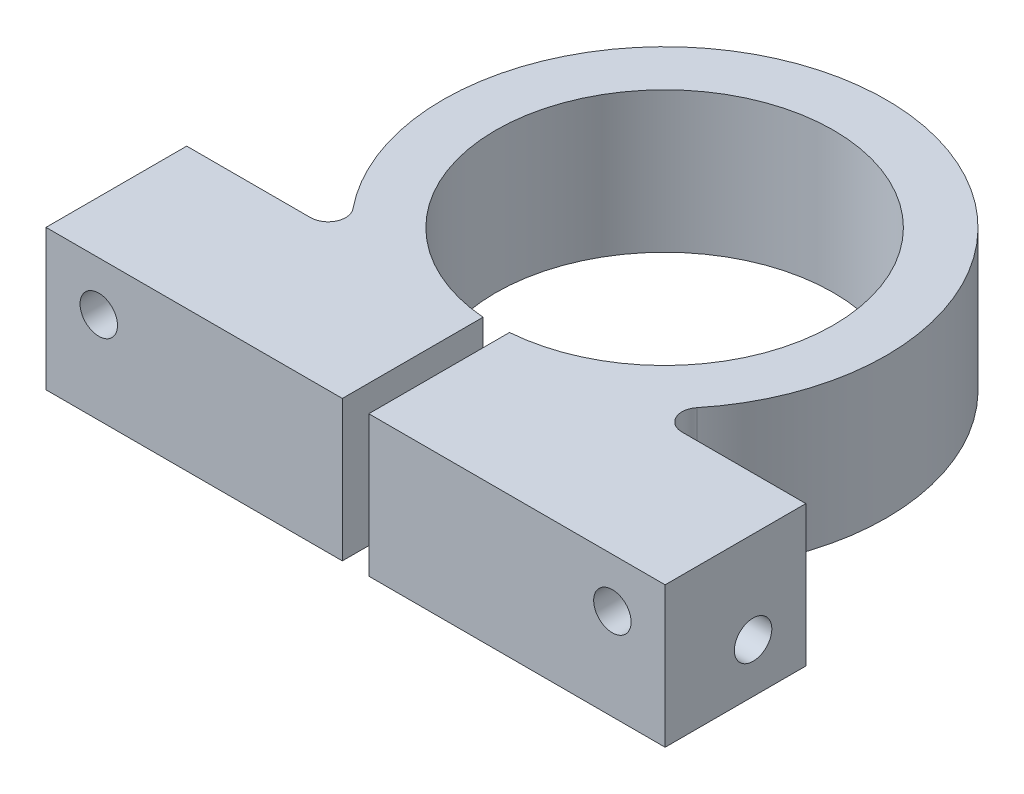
ISO-10303-21;
HEADER;
FILE_DESCRIPTION(('STEP AP214'),'2;1');
FILE_NAME('part.step','',(''),(''),'','','');
FILE_SCHEMA(('AUTOMOTIVE_DESIGN { 1 0 10303 214 1 1 1 1 }'));
ENDSEC;
DATA;
#1=APPLICATION_CONTEXT('core data for automotive mechanical design processes');
#2=APPLICATION_PROTOCOL_DEFINITION('international standard','automotive_design',2000,#1);
#3=PRODUCT_CONTEXT('',#1,'mechanical');
#4=PRODUCT('Part','Part','',(#3));
#5=PRODUCT_RELATED_PRODUCT_CATEGORY('part','',(#4));
#6=PRODUCT_DEFINITION_FORMATION('','',#4);
#7=PRODUCT_DEFINITION_CONTEXT('part definition',#1,'design');
#8=PRODUCT_DEFINITION('design','',#6,#7);
#9=PRODUCT_DEFINITION_SHAPE('','',#8);
#10=(LENGTH_UNIT() NAMED_UNIT(*) SI_UNIT(.MILLI.,.METRE.));
#11=(NAMED_UNIT(*) PLANE_ANGLE_UNIT() SI_UNIT($,.RADIAN.));
#12=(NAMED_UNIT(*) SI_UNIT($,.STERADIAN.) SOLID_ANGLE_UNIT());
#13=UNCERTAINTY_MEASURE_WITH_UNIT(LENGTH_MEASURE(1.E-05),#10,'distance_accuracy_value','');
#14=(GEOMETRIC_REPRESENTATION_CONTEXT(3) GLOBAL_UNCERTAINTY_ASSIGNED_CONTEXT((#13)) GLOBAL_UNIT_ASSIGNED_CONTEXT((#10,
#11,#12)) REPRESENTATION_CONTEXT('',''));
#15=CARTESIAN_POINT('',(0.,0.,0.));
#16=DIRECTION('',(0.,0.,1.));
#17=DIRECTION('',(1.,0.,0.));
#18=AXIS2_PLACEMENT_3D('',#15,#16,#17);
#19=CARTESIAN_POINT('',(-33.5269336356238,25.4,27.211341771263));
#20=DIRECTION('',(0.,-1.,0.));
#21=DIRECTION('',(0.,0.,-1.));
#22=AXIS2_PLACEMENT_3D('',#19,#20,#21);
#23=CYLINDRICAL_SURFACE('',#22,3.175);
#24=CARTESIAN_POINT('',(-33.5269336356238,0.,27.211341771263));
#25=DIRECTION('',(0.,-1.,0.));
#26=DIRECTION('',(0.,0.,1.));
#27=AXIS2_PLACEMENT_3D('',#24,#25,#26);
#28=CIRCLE('',#27,3.175);
#29=CARTESIAN_POINT('',(-31.061717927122,0.,25.2105078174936));
#30=VERTEX_POINT('',#29);
#31=CARTESIAN_POINT('',(-33.5269336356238,0.,30.386341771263));
#32=VERTEX_POINT('',#31);
#33=EDGE_CURVE('E124',#30,#32,#28,.T.);
#34=ORIENTED_EDGE('',*,*,#33,.T.);
#35=DIRECTION('',(0.,-1.,0.));
#36=VECTOR('',#35,1.);
#37=CARTESIAN_POINT('',(-33.5269336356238,25.4,30.386341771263));
#38=LINE('',#37,#36);
#39=CARTESIAN_POINT('',(-33.5269336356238,25.4,30.386341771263));
#40=VERTEX_POINT('',#39);
#41=EDGE_CURVE('E11',#40,#32,#38,.T.);
#42=ORIENTED_EDGE('',*,*,#41,.F.);
#43=CARTESIAN_POINT('',(-33.5269336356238,25.4,27.211341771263));
#44=DIRECTION('',(0.,-1.,0.));
#45=DIRECTION('',(0.,0.,1.));
#46=AXIS2_PLACEMENT_3D('',#43,#44,#45);
#47=CIRCLE('',#46,3.175);
#48=CARTESIAN_POINT('',(-31.061717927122,25.4,25.2105078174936));
#49=VERTEX_POINT('',#48);
#50=EDGE_CURVE('E164',#49,#40,#47,.T.);
#51=ORIENTED_EDGE('',*,*,#50,.F.);
#52=DIRECTION('',(0.,-1.,0.));
#53=VECTOR('',#52,1.);
#54=CARTESIAN_POINT('',(-31.061717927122,25.4,25.2105078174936));
#55=LINE('',#54,#53);
#56=EDGE_CURVE('E137',#49,#30,#55,.T.);
#57=ORIENTED_EDGE('',*,*,#56,.T.);
#58=EDGE_LOOP('',(#34,#42,#51,#57));
#59=FACE_BOUND('',#58,.T.);
#60=ADVANCED_FACE('F32',(#59),#23,.F.);
#61=CARTESIAN_POINT('',(-55.88,25.4,30.386341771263));
#62=DIRECTION('',(0.,0.,1.));
#63=DIRECTION('',(1.,0.,0.));
#64=AXIS2_PLACEMENT_3D('',#61,#62,#63);
#65=PLANE('',#64);
#66=CARTESIAN_POINT('',(-46.355,16.51,30.386341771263));
#67=DIRECTION('',(0.,0.,-1.));
#68=DIRECTION('',(-1.,0.,0.));
#69=AXIS2_PLACEMENT_3D('',#66,#67,#68);
#70=CIRCLE('',#69,3.37819999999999);
#71=CARTESIAN_POINT('',(-49.7332,16.51,30.386341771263));
#72=VERTEX_POINT('',#71);
#73=EDGE_CURVE('E305',#72,#72,#70,.T.);
#74=ORIENTED_EDGE('',*,*,#73,.F.);
#75=EDGE_LOOP('',(#74));
#76=FACE_BOUND('',#75,.T.);
#77=DIRECTION('',(-1.,0.,0.));
#78=VECTOR('',#77,1.);
#79=CARTESIAN_POINT('',(-55.88,0.,30.386341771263));
#80=LINE('',#79,#78);
#81=CARTESIAN_POINT('',(-55.88,0.,30.386341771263));
#82=VERTEX_POINT('',#81);
#83=EDGE_CURVE('E120',#32,#82,#80,.T.);
#84=ORIENTED_EDGE('',*,*,#83,.T.);
#85=DIRECTION('',(0.,-1.,0.));
#86=VECTOR('',#85,1.);
#87=CARTESIAN_POINT('',(-55.88,25.4,30.386341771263));
#88=LINE('',#87,#86);
#89=CARTESIAN_POINT('',(-55.88,25.4,30.386341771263));
#90=VERTEX_POINT('',#89);
#91=EDGE_CURVE('E39',#90,#82,#88,.T.);
#92=ORIENTED_EDGE('',*,*,#91,.F.);
#93=DIRECTION('',(-1.,0.,0.));
#94=VECTOR('',#93,1.);
#95=CARTESIAN_POINT('',(-55.88,25.4,30.386341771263));
#96=LINE('',#95,#94);
#97=EDGE_CURVE('E133',#40,#90,#96,.T.);
#98=ORIENTED_EDGE('',*,*,#97,.F.);
#99=ORIENTED_EDGE('',*,*,#41,.T.);
#100=EDGE_LOOP('',(#84,#92,#98,#99));
#101=FACE_BOUND('',#100,.T.);
#102=ADVANCED_FACE('F132',(#76,#101),#65,.F.);
#103=CARTESIAN_POINT('',(-55.88,25.4,30.386341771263));
#104=DIRECTION('',(1.,0.,0.));
#105=DIRECTION('',(0.,0.,-1.));
#106=AXIS2_PLACEMENT_3D('',#103,#104,#105);
#107=PLANE('',#106);
#108=CARTESIAN_POINT('',(-55.88,8.89,39.911341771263));
#109=DIRECTION('',(-1.,0.,0.));
#110=DIRECTION('',(0.,0.,1.));
#111=AXIS2_PLACEMENT_3D('',#108,#109,#110);
#112=CIRCLE('',#111,3.37819999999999);
#113=CARTESIAN_POINT('',(-55.88,8.89,43.2895417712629));
#114=VERTEX_POINT('',#113);
#115=EDGE_CURVE('E315',#114,#114,#112,.T.);
#116=ORIENTED_EDGE('',*,*,#115,.F.);
#117=EDGE_LOOP('',(#116));
#118=FACE_BOUND('',#117,.T.);
#119=DIRECTION('',(0.,0.,1.));
#120=VECTOR('',#119,1.);
#121=CARTESIAN_POINT('',(-55.88,0.,30.386341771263));
#122=LINE('',#121,#120);
#123=CARTESIAN_POINT('',(-55.88,0.,55.786341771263));
#124=VERTEX_POINT('',#123);
#125=EDGE_CURVE('E126',#82,#124,#122,.T.);
#126=ORIENTED_EDGE('',*,*,#125,.T.);
#127=DIRECTION('',(0.,-1.,0.));
#128=VECTOR('',#127,1.);
#129=CARTESIAN_POINT('',(-55.88,25.4,55.786341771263));
#130=LINE('',#129,#128);
#131=CARTESIAN_POINT('',(-55.88,25.4,55.786341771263));
#132=VERTEX_POINT('',#131);
#133=EDGE_CURVE('E210',#132,#124,#130,.T.);
#134=ORIENTED_EDGE('',*,*,#133,.F.);
#135=DIRECTION('',(0.,0.,1.));
#136=VECTOR('',#135,1.);
#137=CARTESIAN_POINT('',(-55.88,25.4,30.386341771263));
#138=LINE('',#137,#136);
#139=EDGE_CURVE('E167',#90,#132,#138,.T.);
#140=ORIENTED_EDGE('',*,*,#139,.F.);
#141=ORIENTED_EDGE('',*,*,#91,.T.);
#142=EDGE_LOOP('',(#126,#134,#140,#141));
#143=FACE_BOUND('',#142,.T.);
#144=ADVANCED_FACE('F214',(#118,#143),#107,.F.);
#145=CARTESIAN_POINT('',(-55.88,25.4,55.786341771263));
#146=DIRECTION('',(0.,0.,-1.));
#147=DIRECTION('',(-1.,0.,0.));
#148=AXIS2_PLACEMENT_3D('',#145,#146,#147);
#149=PLANE('',#148);
#150=CARTESIAN_POINT('',(-46.355,16.51,55.786341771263));
#151=DIRECTION('',(0.,0.,-1.));
#152=DIRECTION('',(-1.,0.,0.));
#153=AXIS2_PLACEMENT_3D('',#150,#151,#152);
#154=CIRCLE('',#153,3.3782);
#155=CARTESIAN_POINT('',(-49.7332,16.51,55.786341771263));
#156=VERTEX_POINT('',#155);
#157=EDGE_CURVE('E301',#156,#156,#154,.T.);
#158=ORIENTED_EDGE('',*,*,#157,.T.);
#159=EDGE_LOOP('',(#158));
#160=FACE_BOUND('',#159,.T.);
#161=DIRECTION('',(1.,0.,0.));
#162=VECTOR('',#161,1.);
#163=CARTESIAN_POINT('',(-55.88,0.,55.786341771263));
#164=LINE('',#163,#162);
#165=CARTESIAN_POINT('',(-2.3876,0.,55.786341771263));
#166=VERTEX_POINT('',#165);
#167=EDGE_CURVE('E146',#124,#166,#164,.T.);
#168=ORIENTED_EDGE('',*,*,#167,.T.);
#169=DIRECTION('',(0.,-1.,0.));
#170=VECTOR('',#169,1.);
#171=CARTESIAN_POINT('',(-2.3876,25.4,55.786341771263));
#172=LINE('',#171,#170);
#173=CARTESIAN_POINT('',(-2.3876,25.4,55.786341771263));
#174=VERTEX_POINT('',#173);
#175=EDGE_CURVE('E207',#174,#166,#172,.T.);
#176=ORIENTED_EDGE('',*,*,#175,.F.);
#177=DIRECTION('',(1.,0.,0.));
#178=VECTOR('',#177,1.);
#179=CARTESIAN_POINT('',(-55.88,25.4,55.786341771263));
#180=LINE('',#179,#178);
#181=EDGE_CURVE('E169',#132,#174,#180,.T.);
#182=ORIENTED_EDGE('',*,*,#181,.F.);
#183=ORIENTED_EDGE('',*,*,#133,.T.);
#184=EDGE_LOOP('',(#168,#176,#182,#183));
#185=FACE_BOUND('',#184,.T.);
#186=ADVANCED_FACE('F222',(#160,#185),#149,.F.);
#187=CARTESIAN_POINT('',(-2.3876,25.4,55.786341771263));
#188=DIRECTION('',(-1.,0.,0.));
#189=DIRECTION('',(0.,0.,1.));
#190=AXIS2_PLACEMENT_3D('',#187,#188,#189);
#191=PLANE('',#190);
#192=CARTESIAN_POINT('',(-2.3876,8.89,39.911341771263));
#193=DIRECTION('',(-1.,0.,0.));
#194=DIRECTION('',(0.,0.,1.));
#195=AXIS2_PLACEMENT_3D('',#192,#193,#194);
#196=CIRCLE('',#195,3.37819999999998);
#197=CARTESIAN_POINT('',(-2.3876,8.89,43.2895417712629));
#198=VERTEX_POINT('',#197);
#199=EDGE_CURVE('E138',#198,#198,#196,.T.);
#200=ORIENTED_EDGE('',*,*,#199,.T.);
#201=EDGE_LOOP('',(#200));
#202=FACE_BOUND('',#201,.T.);
#203=DIRECTION('',(0.,0.,-1.));
#204=VECTOR('',#203,1.);
#205=CARTESIAN_POINT('',(-2.3876,0.,55.786341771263));
#206=LINE('',#205,#204);
#207=CARTESIAN_POINT('',(-2.3876,0.,30.386341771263));
#208=VERTEX_POINT('',#207);
#209=EDGE_CURVE('E148',#166,#208,#206,.T.);
#210=ORIENTED_EDGE('',*,*,#209,.T.);
#211=DIRECTION('',(0.,-1.,0.));
#212=VECTOR('',#211,1.);
#213=CARTESIAN_POINT('',(-2.3876,25.4,30.386341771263));
#214=LINE('',#213,#212);
#215=CARTESIAN_POINT('',(-2.3876,25.4,30.386341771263));
#216=VERTEX_POINT('',#215);
#217=EDGE_CURVE('E204',#216,#208,#214,.T.);
#218=ORIENTED_EDGE('',*,*,#217,.F.);
#219=DIRECTION('',(0.,0.,-1.));
#220=VECTOR('',#219,1.);
#221=CARTESIAN_POINT('',(-2.3876,25.4,55.786341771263));
#222=LINE('',#221,#220);
#223=EDGE_CURVE('E171',#174,#216,#222,.T.);
#224=ORIENTED_EDGE('',*,*,#223,.F.);
#225=ORIENTED_EDGE('',*,*,#175,.T.);
#226=EDGE_LOOP('',(#210,#218,#224,#225));
#227=FACE_BOUND('',#226,.T.);
#228=ADVANCED_FACE('F225',(#202,#227),#191,.F.);
#229=CARTESIAN_POINT('',(0.,25.4,0.));
#230=DIRECTION('',(0.,-1.,0.));
#231=DIRECTION('',(0.,0.,-1.));
#232=AXIS2_PLACEMENT_3D('',#229,#230,#231);
#233=CYLINDRICAL_SURFACE('',#232,30.48);
#234=CARTESIAN_POINT('',(0.,0.,0.));
#235=DIRECTION('',(0.,-1.,0.));
#236=DIRECTION('',(0.,0.,1.));
#237=AXIS2_PLACEMENT_3D('',#234,#235,#236);
#238=CIRCLE('',#237,30.48);
#239=CARTESIAN_POINT('',(2.3876,0.,30.386341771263));
#240=VERTEX_POINT('',#239);
#241=EDGE_CURVE('E150',#208,#240,#238,.T.);
#242=ORIENTED_EDGE('',*,*,#241,.T.);
#243=DIRECTION('',(0.,-1.,0.));
#244=VECTOR('',#243,1.);
#245=CARTESIAN_POINT('',(2.3876,25.4,30.386341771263));
#246=LINE('',#245,#244);
#247=CARTESIAN_POINT('',(2.3876,25.4,30.386341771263));
#248=VERTEX_POINT('',#247);
#249=EDGE_CURVE('E201',#248,#240,#246,.T.);
#250=ORIENTED_EDGE('',*,*,#249,.F.);
#251=CARTESIAN_POINT('',(0.,25.4,0.));
#252=DIRECTION('',(0.,-1.,0.));
#253=DIRECTION('',(0.,0.,1.));
#254=AXIS2_PLACEMENT_3D('',#251,#252,#253);
#255=CIRCLE('',#254,30.48);
#256=EDGE_CURVE('E173',#216,#248,#255,.T.);
#257=ORIENTED_EDGE('',*,*,#256,.F.);
#258=ORIENTED_EDGE('',*,*,#217,.T.);
#259=EDGE_LOOP('',(#242,#250,#257,#258));
#260=FACE_BOUND('',#259,.T.);
#261=ADVANCED_FACE('F230',(#260),#233,.F.);
#262=CARTESIAN_POINT('',(2.3876,25.4,55.786341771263));
#263=DIRECTION('',(1.,0.,0.));
#264=DIRECTION('',(0.,0.,-1.));
#265=AXIS2_PLACEMENT_3D('',#262,#263,#264);
#266=PLANE('',#265);
#267=CARTESIAN_POINT('',(2.3876,8.89,39.911341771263));
#268=DIRECTION('',(1.,0.,0.));
#269=DIRECTION('',(0.,0.,-1.));
#270=AXIS2_PLACEMENT_3D('',#267,#268,#269);
#271=CIRCLE('',#270,3.37819999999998);
#272=CARTESIAN_POINT('',(2.3876,8.89,36.533141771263));
#273=VERTEX_POINT('',#272);
#274=EDGE_CURVE('E141',#273,#273,#271,.T.);
#275=ORIENTED_EDGE('',*,*,#274,.T.);
#276=EDGE_LOOP('',(#275));
#277=FACE_BOUND('',#276,.T.);
#278=DIRECTION('',(0.,0.,1.));
#279=VECTOR('',#278,1.);
#280=CARTESIAN_POINT('',(2.3876,0.,55.786341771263));
#281=LINE('',#280,#279);
#282=CARTESIAN_POINT('',(2.3876,0.,55.786341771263));
#283=VERTEX_POINT('',#282);
#284=EDGE_CURVE('E152',#240,#283,#281,.T.);
#285=ORIENTED_EDGE('',*,*,#284,.T.);
#286=DIRECTION('',(0.,-1.,0.));
#287=VECTOR('',#286,1.);
#288=CARTESIAN_POINT('',(2.3876,25.4,55.786341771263));
#289=LINE('',#288,#287);
#290=CARTESIAN_POINT('',(2.3876,25.4,55.786341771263));
#291=VERTEX_POINT('',#290);
#292=EDGE_CURVE('E198',#291,#283,#289,.T.);
#293=ORIENTED_EDGE('',*,*,#292,.F.);
#294=DIRECTION('',(0.,0.,1.));
#295=VECTOR('',#294,1.);
#296=CARTESIAN_POINT('',(2.3876,25.4,55.786341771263));
#297=LINE('',#296,#295);
#298=EDGE_CURVE('E175',#248,#291,#297,.T.);
#299=ORIENTED_EDGE('',*,*,#298,.F.);
#300=ORIENTED_EDGE('',*,*,#249,.T.);
#301=EDGE_LOOP('',(#285,#293,#299,#300));
#302=FACE_BOUND('',#301,.T.);
#303=ADVANCED_FACE('F236',(#277,#302),#266,.F.);
#304=CARTESIAN_POINT('',(2.3876,25.4,55.786341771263));
#305=DIRECTION('',(0.,0.,-1.));
#306=DIRECTION('',(-1.,0.,0.));
#307=AXIS2_PLACEMENT_3D('',#304,#305,#306);
#308=PLANE('',#307);
#309=CARTESIAN_POINT('',(46.355,16.51,55.786341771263));
#310=DIRECTION('',(0.,0.,-1.));
#311=DIRECTION('',(-1.,0.,0.));
#312=AXIS2_PLACEMENT_3D('',#309,#310,#311);
#313=CIRCLE('',#312,3.3782);
#314=CARTESIAN_POINT('',(42.9768,16.51,55.786341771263));
#315=VERTEX_POINT('',#314);
#316=EDGE_CURVE('E302',#315,#315,#313,.T.);
#317=ORIENTED_EDGE('',*,*,#316,.T.);
#318=EDGE_LOOP('',(#317));
#319=FACE_BOUND('',#318,.T.);
#320=DIRECTION('',(1.,0.,0.));
#321=VECTOR('',#320,1.);
#322=CARTESIAN_POINT('',(2.3876,0.,55.786341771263));
#323=LINE('',#322,#321);
#324=CARTESIAN_POINT('',(55.88,0.,55.7863417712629));
#325=VERTEX_POINT('',#324);
#326=EDGE_CURVE('E154',#283,#325,#323,.T.);
#327=ORIENTED_EDGE('',*,*,#326,.T.);
#328=DIRECTION('',(0.,-1.,0.));
#329=VECTOR('',#328,1.);
#330=CARTESIAN_POINT('',(55.88,25.4,55.7863417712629));
#331=LINE('',#330,#329);
#332=CARTESIAN_POINT('',(55.88,25.4,55.7863417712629));
#333=VERTEX_POINT('',#332);
#334=EDGE_CURVE('E195',#333,#325,#331,.T.);
#335=ORIENTED_EDGE('',*,*,#334,.F.);
#336=DIRECTION('',(1.,0.,0.));
#337=VECTOR('',#336,1.);
#338=CARTESIAN_POINT('',(2.3876,25.4,55.786341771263));
#339=LINE('',#338,#337);
#340=EDGE_CURVE('E177',#291,#333,#339,.T.);
#341=ORIENTED_EDGE('',*,*,#340,.F.);
#342=ORIENTED_EDGE('',*,*,#292,.T.);
#343=EDGE_LOOP('',(#327,#335,#341,#342));
#344=FACE_BOUND('',#343,.T.);
#345=ADVANCED_FACE('F240',(#319,#344),#308,.F.);
#346=CARTESIAN_POINT('',(55.88,25.4,30.386341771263));
#347=DIRECTION('',(-1.,0.,0.));
#348=DIRECTION('',(0.,0.,1.));
#349=AXIS2_PLACEMENT_3D('',#346,#347,#348);
#350=PLANE('',#349);
#351=CARTESIAN_POINT('',(55.88,8.89,39.911341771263));
#352=DIRECTION('',(-1.,0.,0.));
#353=DIRECTION('',(0.,0.,1.));
#354=AXIS2_PLACEMENT_3D('',#351,#352,#353);
#355=CIRCLE('',#354,3.37819999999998);
#356=CARTESIAN_POINT('',(55.88,8.89,43.2895417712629));
#357=VERTEX_POINT('',#356);
#358=EDGE_CURVE('E312',#357,#357,#355,.T.);
#359=ORIENTED_EDGE('',*,*,#358,.T.);
#360=EDGE_LOOP('',(#359));
#361=FACE_BOUND('',#360,.T.);
#362=DIRECTION('',(0.,0.,-1.));
#363=VECTOR('',#362,1.);
#364=CARTESIAN_POINT('',(55.88,0.,30.386341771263));
#365=LINE('',#364,#363);
#366=CARTESIAN_POINT('',(55.88,0.,30.386341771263));
#367=VERTEX_POINT('',#366);
#368=EDGE_CURVE('E156',#325,#367,#365,.T.);
#369=ORIENTED_EDGE('',*,*,#368,.T.);
#370=DIRECTION('',(0.,-1.,0.));
#371=VECTOR('',#370,1.);
#372=CARTESIAN_POINT('',(55.88,25.4,30.386341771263));
#373=LINE('',#372,#371);
#374=CARTESIAN_POINT('',(55.88,25.4,30.386341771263));
#375=VERTEX_POINT('',#374);
#376=EDGE_CURVE('E192',#375,#367,#373,.T.);
#377=ORIENTED_EDGE('',*,*,#376,.F.);
#378=DIRECTION('',(0.,0.,-1.));
#379=VECTOR('',#378,1.);
#380=CARTESIAN_POINT('',(55.88,25.4,30.386341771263));
#381=LINE('',#380,#379);
#382=EDGE_CURVE('E179',#333,#375,#381,.T.);
#383=ORIENTED_EDGE('',*,*,#382,.F.);
#384=ORIENTED_EDGE('',*,*,#334,.T.);
#385=EDGE_LOOP('',(#369,#377,#383,#384));
#386=FACE_BOUND('',#385,.T.);
#387=ADVANCED_FACE('F245',(#361,#386),#350,.F.);
#388=CARTESIAN_POINT('',(33.5269336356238,25.4,30.386341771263));
#389=DIRECTION('',(0.,0.,1.));
#390=DIRECTION('',(1.,0.,0.));
#391=AXIS2_PLACEMENT_3D('',#388,#389,#390);
#392=PLANE('',#391);
#393=CARTESIAN_POINT('',(46.355,16.51,30.386341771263));
#394=DIRECTION('',(0.,0.,-1.));
#395=DIRECTION('',(-1.,0.,0.));
#396=AXIS2_PLACEMENT_3D('',#393,#394,#395);
#397=CIRCLE('',#396,3.37819999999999);
#398=CARTESIAN_POINT('',(42.9768,16.51,30.386341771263));
#399=VERTEX_POINT('',#398);
#400=EDGE_CURVE('E299',#399,#399,#397,.T.);
#401=ORIENTED_EDGE('',*,*,#400,.F.);
#402=EDGE_LOOP('',(#401));
#403=FACE_BOUND('',#402,.T.);
#404=DIRECTION('',(-1.,0.,0.));
#405=VECTOR('',#404,1.);
#406=CARTESIAN_POINT('',(33.5269336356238,0.,30.386341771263));
#407=LINE('',#406,#405);
#408=CARTESIAN_POINT('',(33.5269336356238,0.,30.386341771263));
#409=VERTEX_POINT('',#408);
#410=EDGE_CURVE('E158',#367,#409,#407,.T.);
#411=ORIENTED_EDGE('',*,*,#410,.T.);
#412=DIRECTION('',(0.,-1.,0.));
#413=VECTOR('',#412,1.);
#414=CARTESIAN_POINT('',(33.5269336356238,25.4,30.386341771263));
#415=LINE('',#414,#413);
#416=CARTESIAN_POINT('',(33.5269336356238,25.4,30.386341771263));
#417=VERTEX_POINT('',#416);
#418=EDGE_CURVE('E189',#417,#409,#415,.T.);
#419=ORIENTED_EDGE('',*,*,#418,.F.);
#420=DIRECTION('',(-1.,0.,0.));
#421=VECTOR('',#420,1.);
#422=CARTESIAN_POINT('',(33.5269336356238,25.4,30.386341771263));
#423=LINE('',#422,#421);
#424=EDGE_CURVE('E181',#375,#417,#423,.T.);
#425=ORIENTED_EDGE('',*,*,#424,.F.);
#426=ORIENTED_EDGE('',*,*,#376,.T.);
#427=EDGE_LOOP('',(#411,#419,#425,#426));
#428=FACE_BOUND('',#427,.T.);
#429=ADVANCED_FACE('F249',(#403,#428),#392,.F.);
#430=CARTESIAN_POINT('',(33.5269336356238,25.4,27.211341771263));
#431=DIRECTION('',(0.,-1.,0.));
#432=DIRECTION('',(0.,0.,-1.));
#433=AXIS2_PLACEMENT_3D('',#430,#431,#432);
#434=CYLINDRICAL_SURFACE('',#433,3.175);
#435=CARTESIAN_POINT('',(33.5269336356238,0.,27.211341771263));
#436=DIRECTION('',(0.,-1.,0.));
#437=DIRECTION('',(0.,0.,1.));
#438=AXIS2_PLACEMENT_3D('',#435,#436,#437);
#439=CIRCLE('',#438,3.175);
#440=CARTESIAN_POINT('',(31.061717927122,0.,25.2105078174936));
#441=VERTEX_POINT('',#440);
#442=EDGE_CURVE('E160',#409,#441,#439,.T.);
#443=ORIENTED_EDGE('',*,*,#442,.T.);
#444=DIRECTION('',(0.,-1.,0.));
#445=VECTOR('',#444,1.);
#446=CARTESIAN_POINT('',(31.061717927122,25.4,25.2105078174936));
#447=LINE('',#446,#445);
#448=CARTESIAN_POINT('',(31.061717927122,25.4,25.2105078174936));
#449=VERTEX_POINT('',#448);
#450=EDGE_CURVE('E186',#449,#441,#447,.T.);
#451=ORIENTED_EDGE('',*,*,#450,.F.);
#452=CARTESIAN_POINT('',(33.5269336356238,25.4,27.211341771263));
#453=DIRECTION('',(0.,-1.,0.));
#454=DIRECTION('',(0.,0.,1.));
#455=AXIS2_PLACEMENT_3D('',#452,#453,#454);
#456=CIRCLE('',#455,3.175);
#457=EDGE_CURVE('E51',#417,#449,#456,.T.);
#458=ORIENTED_EDGE('',*,*,#457,.F.);
#459=ORIENTED_EDGE('',*,*,#418,.T.);
#460=EDGE_LOOP('',(#443,#451,#458,#459));
#461=FACE_BOUND('',#460,.T.);
#462=ADVANCED_FACE('F253',(#461),#434,.F.);
#463=CARTESIAN_POINT('',(0.,25.4,0.));
#464=DIRECTION('',(0.,-1.,0.));
#465=DIRECTION('',(0.,0.,-1.));
#466=AXIS2_PLACEMENT_3D('',#463,#464,#465);
#467=CYLINDRICAL_SURFACE('',#466,40.005);
#468=CARTESIAN_POINT('',(0.,0.,0.));
#469=DIRECTION('',(0.,1.,0.));
#470=DIRECTION('',(0.,0.,1.));
#471=AXIS2_PLACEMENT_3D('',#468,#469,#470);
#472=CIRCLE('',#471,40.005);
#473=EDGE_CURVE('E162',#441,#30,#472,.T.);
#474=ORIENTED_EDGE('',*,*,#473,.T.);
#475=ORIENTED_EDGE('',*,*,#56,.F.);
#476=CARTESIAN_POINT('',(0.,25.4,0.));
#477=DIRECTION('',(0.,1.,0.));
#478=DIRECTION('',(0.,0.,1.));
#479=AXIS2_PLACEMENT_3D('',#476,#477,#478);
#480=CIRCLE('',#479,40.005);
#481=EDGE_CURVE('E46',#449,#49,#480,.T.);
#482=ORIENTED_EDGE('',*,*,#481,.F.);
#483=ORIENTED_EDGE('',*,*,#450,.T.);
#484=EDGE_LOOP('',(#474,#475,#482,#483));
#485=FACE_BOUND('',#484,.T.);
#486=ADVANCED_FACE('F255',(#485),#467,.T.);
#487=CARTESIAN_POINT('',(-33.5269336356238,25.4,27.211341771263));
#488=DIRECTION('',(0.,1.,0.));
#489=DIRECTION('',(0.,0.,1.));
#490=AXIS2_PLACEMENT_3D('',#487,#488,#489);
#491=PLANE('',#490);
#492=ORIENTED_EDGE('',*,*,#50,.T.);
#493=ORIENTED_EDGE('',*,*,#97,.T.);
#494=ORIENTED_EDGE('',*,*,#139,.T.);
#495=ORIENTED_EDGE('',*,*,#181,.T.);
#496=ORIENTED_EDGE('',*,*,#223,.T.);
#497=ORIENTED_EDGE('',*,*,#256,.T.);
#498=ORIENTED_EDGE('',*,*,#298,.T.);
#499=ORIENTED_EDGE('',*,*,#340,.T.);
#500=ORIENTED_EDGE('',*,*,#382,.T.);
#501=ORIENTED_EDGE('',*,*,#424,.T.);
#502=ORIENTED_EDGE('',*,*,#457,.T.);
#503=ORIENTED_EDGE('',*,*,#481,.T.);
#504=EDGE_LOOP('',(#492,#493,#494,#495,#496,#497,#498,#499,#500,#501,#502,#503));
#505=FACE_BOUND('',#504,.T.);
#506=ADVANCED_FACE('F217',(#505),#491,.T.);
#507=CARTESIAN_POINT('',(-33.5269336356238,0.,27.211341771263));
#508=DIRECTION('',(0.,1.,0.));
#509=DIRECTION('',(0.,0.,1.));
#510=AXIS2_PLACEMENT_3D('',#507,#508,#509);
#511=PLANE('',#510);
#512=ORIENTED_EDGE('',*,*,#33,.F.);
#513=ORIENTED_EDGE('',*,*,#473,.F.);
#514=ORIENTED_EDGE('',*,*,#442,.F.);
#515=ORIENTED_EDGE('',*,*,#410,.F.);
#516=ORIENTED_EDGE('',*,*,#368,.F.);
#517=ORIENTED_EDGE('',*,*,#326,.F.);
#518=ORIENTED_EDGE('',*,*,#284,.F.);
#519=ORIENTED_EDGE('',*,*,#241,.F.);
#520=ORIENTED_EDGE('',*,*,#209,.F.);
#521=ORIENTED_EDGE('',*,*,#167,.F.);
#522=ORIENTED_EDGE('',*,*,#125,.F.);
#523=ORIENTED_EDGE('',*,*,#83,.F.);
#524=EDGE_LOOP('',(#512,#513,#514,#515,#516,#517,#518,#519,#520,#521,#522,#523));
#525=FACE_BOUND('',#524,.T.);
#526=ADVANCED_FACE('F121',(#525),#511,.F.);
#527=CARTESIAN_POINT('',(-55.88,8.89,39.911341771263));
#528=DIRECTION('',(-1.,0.,0.));
#529=DIRECTION('',(0.,0.,1.));
#530=AXIS2_PLACEMENT_3D('',#527,#528,#529);
#531=CYLINDRICAL_SURFACE('',#530,3.37819999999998);
#532=ORIENTED_EDGE('',*,*,#358,.F.);
#533=EDGE_LOOP('',(#532));
#534=FACE_BOUND('',#533,.T.);
#535=ORIENTED_EDGE('',*,*,#274,.F.);
#536=EDGE_LOOP('',(#535));
#537=FACE_BOUND('',#536,.T.);
#538=ADVANCED_FACE('F320',(#534,#537),#531,.F.);
#539=ORIENTED_EDGE('',*,*,#115,.T.);
#540=EDGE_LOOP('',(#539));
#541=FACE_BOUND('',#540,.T.);
#542=ORIENTED_EDGE('',*,*,#199,.F.);
#543=EDGE_LOOP('',(#542));
#544=FACE_BOUND('',#543,.T.);
#545=ADVANCED_FACE('F322',(#541,#544),#531,.F.);
#546=CARTESIAN_POINT('',(-46.355,16.51,30.386341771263));
#547=DIRECTION('',(0.,0.,-1.));
#548=DIRECTION('',(-1.,0.,0.));
#549=AXIS2_PLACEMENT_3D('',#546,#547,#548);
#550=CYLINDRICAL_SURFACE('',#549,3.37819999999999);
#551=ORIENTED_EDGE('',*,*,#157,.F.);
#552=EDGE_LOOP('',(#551));
#553=FACE_BOUND('',#552,.T.);
#554=ORIENTED_EDGE('',*,*,#73,.T.);
#555=EDGE_LOOP('',(#554));
#556=FACE_BOUND('',#555,.T.);
#557=ADVANCED_FACE('F329',(#553,#556),#550,.F.);
#558=CARTESIAN_POINT('',(46.355,16.51,30.386341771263));
#559=DIRECTION('',(0.,0.,-1.));
#560=DIRECTION('',(-1.,0.,0.));
#561=AXIS2_PLACEMENT_3D('',#558,#559,#560);
#562=CYLINDRICAL_SURFACE('',#561,3.37819999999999);
#563=ORIENTED_EDGE('',*,*,#316,.F.);
#564=EDGE_LOOP('',(#563));
#565=FACE_BOUND('',#564,.T.);
#566=ORIENTED_EDGE('',*,*,#400,.T.);
#567=EDGE_LOOP('',(#566));
#568=FACE_BOUND('',#567,.T.);
#569=ADVANCED_FACE('F336',(#565,#568),#562,.F.);
#570=CLOSED_SHELL('',(#60,#102,#144,#186,#228,#261,#303,#345,#387,#429,#462,#486,#506,#526,#538,
#545,#557,#569));
#571=MANIFOLD_SOLID_BREP('B2',#570);
#572=ADVANCED_BREP_SHAPE_REPRESENTATION('',(#18,#571),#14);
#573=SHAPE_DEFINITION_REPRESENTATION(#9,#572);
ENDSEC;
END-ISO-10303-21;
